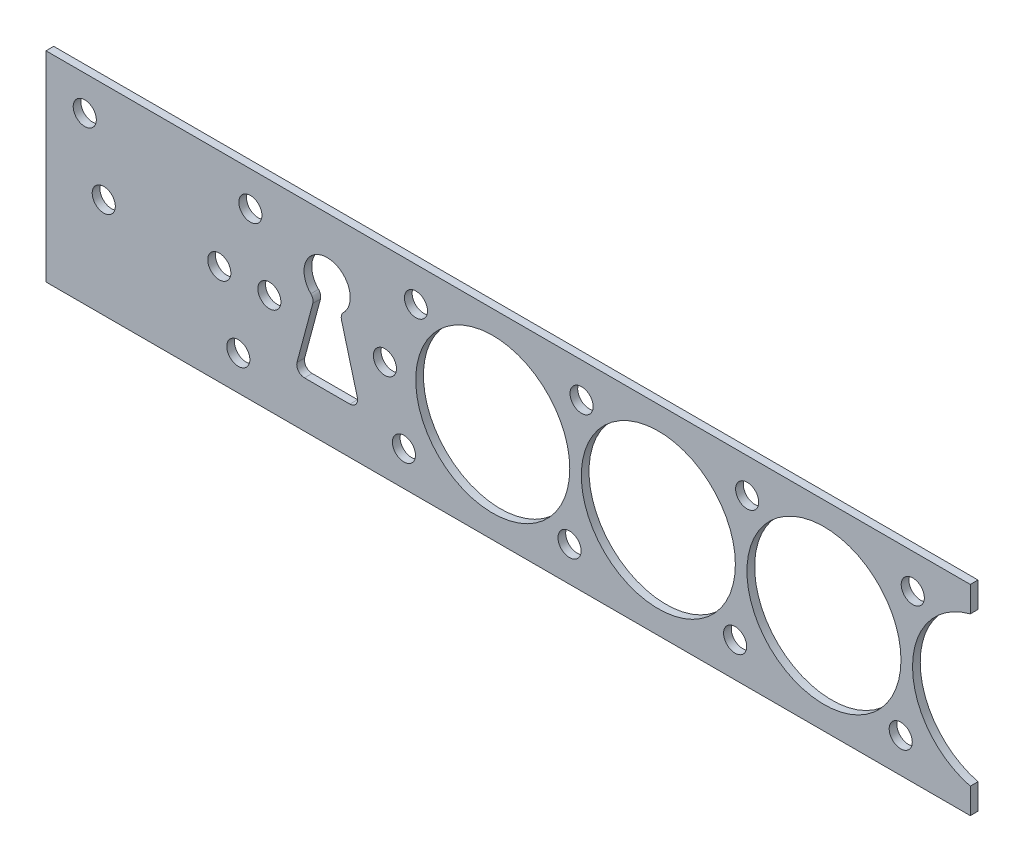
ISO-10303-21;
HEADER;
FILE_DESCRIPTION(('STEP AP214'),'2;1');
FILE_NAME('part.step','',(''),(''),'','','');
FILE_SCHEMA(('AUTOMOTIVE_DESIGN { 1 0 10303 214 1 1 1 1 }'));
ENDSEC;
DATA;
#1=APPLICATION_CONTEXT('core data for automotive mechanical design processes');
#2=APPLICATION_PROTOCOL_DEFINITION('international standard','automotive_design',2000,#1);
#3=PRODUCT_CONTEXT('',#1,'mechanical');
#4=PRODUCT('Part','Part','',(#3));
#5=PRODUCT_RELATED_PRODUCT_CATEGORY('part','',(#4));
#6=PRODUCT_DEFINITION_FORMATION('','',#4);
#7=PRODUCT_DEFINITION_CONTEXT('part definition',#1,'design');
#8=PRODUCT_DEFINITION('design','',#6,#7);
#9=PRODUCT_DEFINITION_SHAPE('','',#8);
#10=(LENGTH_UNIT() NAMED_UNIT(*) SI_UNIT(.MILLI.,.METRE.));
#11=(NAMED_UNIT(*) PLANE_ANGLE_UNIT() SI_UNIT($,.RADIAN.));
#12=(NAMED_UNIT(*) SI_UNIT($,.STERADIAN.) SOLID_ANGLE_UNIT());
#13=UNCERTAINTY_MEASURE_WITH_UNIT(LENGTH_MEASURE(1.E-05),#10,'distance_accuracy_value','');
#14=(GEOMETRIC_REPRESENTATION_CONTEXT(3) GLOBAL_UNCERTAINTY_ASSIGNED_CONTEXT((#13)) GLOBAL_UNIT_ASSIGNED_CONTEXT((#10,
#11,#12)) REPRESENTATION_CONTEXT('',''));
#15=CARTESIAN_POINT('',(0.,0.,0.));
#16=DIRECTION('',(0.,0.,1.));
#17=DIRECTION('',(1.,0.,0.));
#18=AXIS2_PLACEMENT_3D('',#15,#16,#17);
#19=CARTESIAN_POINT('',(29.,0.,123.784363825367));
#20=DIRECTION('',(0.,0.,-1.));
#21=DIRECTION('',(-1.,0.,0.));
#22=AXIS2_PLACEMENT_3D('',#19,#20,#21);
#23=CYLINDRICAL_SURFACE('',#22,1.5);
#24=CARTESIAN_POINT('',(29.,0.,0.));
#25=DIRECTION('',(0.,0.,1.));
#26=DIRECTION('',(1.,0.,0.));
#27=AXIS2_PLACEMENT_3D('',#24,#25,#26);
#28=CIRCLE('',#27,1.5);
#29=CARTESIAN_POINT('',(30.5,0.,0.));
#30=VERTEX_POINT('',#29);
#31=EDGE_CURVE('E247',#30,#30,#28,.T.);
#32=ORIENTED_EDGE('',*,*,#31,.F.);
#33=EDGE_LOOP('',(#32));
#34=FACE_BOUND('',#33,.T.);
#35=CARTESIAN_POINT('',(29.,0.,1.));
#36=DIRECTION('',(0.,0.,1.));
#37=DIRECTION('',(1.,0.,0.));
#38=AXIS2_PLACEMENT_3D('',#35,#36,#37);
#39=CIRCLE('',#38,1.5);
#40=CARTESIAN_POINT('',(30.5,0.,1.));
#41=VERTEX_POINT('',#40);
#42=EDGE_CURVE('E602',#41,#41,#39,.T.);
#43=ORIENTED_EDGE('',*,*,#42,.T.);
#44=EDGE_LOOP('',(#43));
#45=FACE_BOUND('',#44,.T.);
#46=ADVANCED_FACE('F33',(#34,#45),#23,.F.);
#47=CARTESIAN_POINT('',(97.5320513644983,8.49999999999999,123.784363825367));
#48=DIRECTION('',(0.,0.,-1.));
#49=DIRECTION('',(-1.,0.,0.));
#50=AXIS2_PLACEMENT_3D('',#47,#48,#49);
#51=CYLINDRICAL_SURFACE('',#50,1.5);
#52=CARTESIAN_POINT('',(97.5320513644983,8.49999999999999,0.));
#53=DIRECTION('',(0.,0.,1.));
#54=DIRECTION('',(1.,0.,0.));
#55=AXIS2_PLACEMENT_3D('',#52,#53,#54);
#56=CIRCLE('',#55,1.5);
#57=CARTESIAN_POINT('',(99.0320513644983,8.49999999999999,0.));
#58=VERTEX_POINT('',#57);
#59=EDGE_CURVE('E253',#58,#58,#56,.T.);
#60=ORIENTED_EDGE('',*,*,#59,.F.);
#61=EDGE_LOOP('',(#60));
#62=FACE_BOUND('',#61,.T.);
#63=CARTESIAN_POINT('',(97.5320513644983,8.49999999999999,1.));
#64=DIRECTION('',(0.,0.,1.));
#65=DIRECTION('',(1.,0.,0.));
#66=AXIS2_PLACEMENT_3D('',#63,#64,#65);
#67=CIRCLE('',#66,1.5);
#68=CARTESIAN_POINT('',(99.0320513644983,8.49999999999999,1.));
#69=VERTEX_POINT('',#68);
#70=EDGE_CURVE('E610',#69,#69,#67,.T.);
#71=ORIENTED_EDGE('',*,*,#70,.T.);
#72=EDGE_LOOP('',(#71));
#73=FACE_BOUND('',#72,.T.);
#74=ADVANCED_FACE('F352',(#62,#73),#51,.F.);
#75=CARTESIAN_POINT('',(76.0320513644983,8.49999999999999,123.784363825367));
#76=DIRECTION('',(0.,0.,-1.));
#77=DIRECTION('',(-1.,0.,0.));
#78=AXIS2_PLACEMENT_3D('',#75,#76,#77);
#79=CYLINDRICAL_SURFACE('',#78,1.5);
#80=CARTESIAN_POINT('',(76.0320513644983,8.49999999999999,0.));
#81=DIRECTION('',(0.,0.,1.));
#82=DIRECTION('',(1.,0.,0.));
#83=AXIS2_PLACEMENT_3D('',#80,#81,#82);
#84=CIRCLE('',#83,1.5);
#85=CARTESIAN_POINT('',(77.5320513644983,8.49999999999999,0.));
#86=VERTEX_POINT('',#85);
#87=EDGE_CURVE('E259',#86,#86,#84,.T.);
#88=ORIENTED_EDGE('',*,*,#87,.F.);
#89=EDGE_LOOP('',(#88));
#90=FACE_BOUND('',#89,.T.);
#91=CARTESIAN_POINT('',(76.0320513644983,8.49999999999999,1.));
#92=DIRECTION('',(0.,0.,1.));
#93=DIRECTION('',(1.,0.,0.));
#94=AXIS2_PLACEMENT_3D('',#91,#92,#93);
#95=CIRCLE('',#94,1.5);
#96=CARTESIAN_POINT('',(77.5320513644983,8.49999999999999,1.));
#97=VERTEX_POINT('',#96);
#98=EDGE_CURVE('E618',#97,#97,#95,.T.);
#99=ORIENTED_EDGE('',*,*,#98,.T.);
#100=EDGE_LOOP('',(#99));
#101=FACE_BOUND('',#100,.T.);
#102=ADVANCED_FACE('F358',(#90,#101),#79,.F.);
#103=CARTESIAN_POINT('',(54.5320513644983,8.49999999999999,123.784363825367));
#104=DIRECTION('',(0.,0.,-1.));
#105=DIRECTION('',(-1.,0.,0.));
#106=AXIS2_PLACEMENT_3D('',#103,#104,#105);
#107=CYLINDRICAL_SURFACE('',#106,1.5);
#108=CARTESIAN_POINT('',(54.5320513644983,8.49999999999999,0.));
#109=DIRECTION('',(0.,0.,1.));
#110=DIRECTION('',(1.,0.,0.));
#111=AXIS2_PLACEMENT_3D('',#108,#109,#110);
#112=CIRCLE('',#111,1.5);
#113=CARTESIAN_POINT('',(56.0320513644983,8.49999999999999,0.));
#114=VERTEX_POINT('',#113);
#115=EDGE_CURVE('E265',#114,#114,#112,.T.);
#116=ORIENTED_EDGE('',*,*,#115,.F.);
#117=EDGE_LOOP('',(#116));
#118=FACE_BOUND('',#117,.T.);
#119=CARTESIAN_POINT('',(54.5320513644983,8.49999999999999,1.));
#120=DIRECTION('',(0.,0.,1.));
#121=DIRECTION('',(1.,0.,0.));
#122=AXIS2_PLACEMENT_3D('',#119,#120,#121);
#123=CIRCLE('',#122,1.5);
#124=CARTESIAN_POINT('',(56.0320513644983,8.49999999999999,1.));
#125=VERTEX_POINT('',#124);
#126=EDGE_CURVE('E626',#125,#125,#123,.T.);
#127=ORIENTED_EDGE('',*,*,#126,.T.);
#128=EDGE_LOOP('',(#127));
#129=FACE_BOUND('',#128,.T.);
#130=ADVANCED_FACE('F378',(#118,#129),#107,.F.);
#131=CARTESIAN_POINT('',(33.0320513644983,8.49999999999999,123.784363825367));
#132=DIRECTION('',(0.,0.,-1.));
#133=DIRECTION('',(-1.,0.,0.));
#134=AXIS2_PLACEMENT_3D('',#131,#132,#133);
#135=CYLINDRICAL_SURFACE('',#134,1.5);
#136=CARTESIAN_POINT('',(33.0320513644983,8.49999999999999,0.));
#137=DIRECTION('',(0.,0.,1.));
#138=DIRECTION('',(1.,0.,0.));
#139=AXIS2_PLACEMENT_3D('',#136,#137,#138);
#140=CIRCLE('',#139,1.5);
#141=CARTESIAN_POINT('',(34.5320513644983,8.49999999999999,0.));
#142=VERTEX_POINT('',#141);
#143=EDGE_CURVE('E271',#142,#142,#140,.T.);
#144=ORIENTED_EDGE('',*,*,#143,.F.);
#145=EDGE_LOOP('',(#144));
#146=FACE_BOUND('',#145,.T.);
#147=CARTESIAN_POINT('',(33.0320513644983,8.49999999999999,1.));
#148=DIRECTION('',(0.,0.,1.));
#149=DIRECTION('',(1.,0.,0.));
#150=AXIS2_PLACEMENT_3D('',#147,#148,#149);
#151=CIRCLE('',#150,1.5);
#152=CARTESIAN_POINT('',(34.5320513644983,8.49999999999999,1.));
#153=VERTEX_POINT('',#152);
#154=EDGE_CURVE('E634',#153,#153,#151,.T.);
#155=ORIENTED_EDGE('',*,*,#154,.T.);
#156=EDGE_LOOP('',(#155));
#157=FACE_BOUND('',#156,.T.);
#158=ADVANCED_FACE('F386',(#146,#157),#135,.F.);
#159=CARTESIAN_POINT('',(11.5320513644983,8.49999999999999,123.784363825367));
#160=DIRECTION('',(0.,0.,-1.));
#161=DIRECTION('',(-1.,0.,0.));
#162=AXIS2_PLACEMENT_3D('',#159,#160,#161);
#163=CYLINDRICAL_SURFACE('',#162,1.5);
#164=CARTESIAN_POINT('',(11.5320513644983,8.49999999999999,0.));
#165=DIRECTION('',(0.,0.,1.));
#166=DIRECTION('',(1.,0.,0.));
#167=AXIS2_PLACEMENT_3D('',#164,#165,#166);
#168=CIRCLE('',#167,1.5);
#169=CARTESIAN_POINT('',(13.0320513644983,8.49999999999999,0.));
#170=VERTEX_POINT('',#169);
#171=EDGE_CURVE('E277',#170,#170,#168,.T.);
#172=ORIENTED_EDGE('',*,*,#171,.F.);
#173=EDGE_LOOP('',(#172));
#174=FACE_BOUND('',#173,.T.);
#175=CARTESIAN_POINT('',(11.5320513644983,8.49999999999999,1.));
#176=DIRECTION('',(0.,0.,1.));
#177=DIRECTION('',(1.,0.,0.));
#178=AXIS2_PLACEMENT_3D('',#175,#176,#177);
#179=CIRCLE('',#178,1.5);
#180=CARTESIAN_POINT('',(13.0320513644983,8.49999999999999,1.));
#181=VERTEX_POINT('',#180);
#182=EDGE_CURVE('E642',#181,#181,#179,.T.);
#183=ORIENTED_EDGE('',*,*,#182,.T.);
#184=EDGE_LOOP('',(#183));
#185=FACE_BOUND('',#184,.T.);
#186=ADVANCED_FACE('F394',(#174,#185),#163,.F.);
#187=CARTESIAN_POINT('',(-7.5,0.,123.784363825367));
#188=DIRECTION('',(0.,0.,-1.));
#189=DIRECTION('',(-1.,0.,0.));
#190=AXIS2_PLACEMENT_3D('',#187,#188,#189);
#191=CYLINDRICAL_SURFACE('',#190,1.5);
#192=CARTESIAN_POINT('',(-7.5,0.,0.));
#193=DIRECTION('',(0.,0.,1.));
#194=DIRECTION('',(1.,0.,0.));
#195=AXIS2_PLACEMENT_3D('',#192,#193,#194);
#196=CIRCLE('',#195,1.5);
#197=CARTESIAN_POINT('',(-6.,0.,0.));
#198=VERTEX_POINT('',#197);
#199=EDGE_CURVE('E283',#198,#198,#196,.T.);
#200=ORIENTED_EDGE('',*,*,#199,.F.);
#201=EDGE_LOOP('',(#200));
#202=FACE_BOUND('',#201,.T.);
#203=CARTESIAN_POINT('',(-7.5,0.,1.));
#204=DIRECTION('',(0.,0.,1.));
#205=DIRECTION('',(1.,0.,0.));
#206=AXIS2_PLACEMENT_3D('',#203,#204,#205);
#207=CIRCLE('',#206,1.5);
#208=CARTESIAN_POINT('',(-6.,0.,1.));
#209=VERTEX_POINT('',#208);
#210=EDGE_CURVE('E140',#209,#209,#207,.T.);
#211=ORIENTED_EDGE('',*,*,#210,.T.);
#212=EDGE_LOOP('',(#211));
#213=FACE_BOUND('',#212,.T.);
#214=ADVANCED_FACE('F402',(#202,#213),#191,.F.);
#215=CARTESIAN_POINT('',(43.,0.,123.784363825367));
#216=DIRECTION('',(0.,0.,-1.));
#217=DIRECTION('',(-1.,0.,0.));
#218=AXIS2_PLACEMENT_3D('',#215,#216,#217);
#219=CYLINDRICAL_SURFACE('',#218,10.);
#220=CARTESIAN_POINT('',(43.,0.,0.));
#221=DIRECTION('',(0.,0.,1.));
#222=DIRECTION('',(1.,0.,0.));
#223=AXIS2_PLACEMENT_3D('',#220,#221,#222);
#224=CIRCLE('',#223,10.);
#225=CARTESIAN_POINT('',(53.,0.,0.));
#226=VERTEX_POINT('',#225);
#227=EDGE_CURVE('E171',#226,#226,#224,.T.);
#228=ORIENTED_EDGE('',*,*,#227,.F.);
#229=EDGE_LOOP('',(#228));
#230=FACE_BOUND('',#229,.T.);
#231=CARTESIAN_POINT('',(43.,0.,1.));
#232=DIRECTION('',(0.,0.,1.));
#233=DIRECTION('',(1.,0.,0.));
#234=AXIS2_PLACEMENT_3D('',#231,#232,#233);
#235=CIRCLE('',#234,10.);
#236=CARTESIAN_POINT('',(53.,0.,1.));
#237=VERTEX_POINT('',#236);
#238=EDGE_CURVE('E328',#237,#237,#235,.T.);
#239=ORIENTED_EDGE('',*,*,#238,.T.);
#240=EDGE_LOOP('',(#239));
#241=FACE_BOUND('',#240,.T.);
#242=ADVANCED_FACE('F410',(#230,#241),#219,.F.);
#243=CARTESIAN_POINT('',(-9.96794863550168,8.49999999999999,123.784363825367));
#244=DIRECTION('',(0.,0.,-1.));
#245=DIRECTION('',(-1.,0.,0.));
#246=AXIS2_PLACEMENT_3D('',#243,#244,#245);
#247=CYLINDRICAL_SURFACE('',#246,1.5);
#248=CARTESIAN_POINT('',(-9.96794863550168,8.49999999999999,0.));
#249=DIRECTION('',(0.,0.,1.));
#250=DIRECTION('',(1.,0.,0.));
#251=AXIS2_PLACEMENT_3D('',#248,#249,#250);
#252=CIRCLE('',#251,1.5);
#253=CARTESIAN_POINT('',(-8.46794863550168,8.49999999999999,0.));
#254=VERTEX_POINT('',#253);
#255=EDGE_CURVE('E177',#254,#254,#252,.T.);
#256=ORIENTED_EDGE('',*,*,#255,.F.);
#257=EDGE_LOOP('',(#256));
#258=FACE_BOUND('',#257,.T.);
#259=CARTESIAN_POINT('',(-9.96794863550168,8.49999999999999,1.));
#260=DIRECTION('',(0.,0.,1.));
#261=DIRECTION('',(1.,0.,0.));
#262=AXIS2_PLACEMENT_3D('',#259,#260,#261);
#263=CIRCLE('',#262,1.5);
#264=CARTESIAN_POINT('',(-8.46794863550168,8.49999999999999,1.));
#265=VERTEX_POINT('',#264);
#266=EDGE_CURVE('E334',#265,#265,#263,.T.);
#267=ORIENTED_EDGE('',*,*,#266,.T.);
#268=EDGE_LOOP('',(#267));
#269=FACE_BOUND('',#268,.T.);
#270=ADVANCED_FACE('F438',(#258,#269),#247,.F.);
#271=CARTESIAN_POINT('',(-15.,13.,123.784363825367));
#272=DIRECTION('',(0.,-1.,0.));
#273=DIRECTION('',(0.,0.,-1.));
#274=AXIS2_PLACEMENT_3D('',#271,#272,#273);
#275=PLANE('',#274);
#276=DIRECTION('',(-1.,0.,0.));
#277=VECTOR('',#276,1.);
#278=CARTESIAN_POINT('',(-15.,13.,1.));
#279=LINE('',#278,#277);
#280=CARTESIAN_POINT('',(105.,13.,1.));
#281=VERTEX_POINT('',#280);
#282=CARTESIAN_POINT('',(-15.,13.,1.));
#283=VERTEX_POINT('',#282);
#284=EDGE_CURVE('E337',#281,#283,#279,.T.);
#285=ORIENTED_EDGE('',*,*,#284,.F.);
#286=DIRECTION('',(0.,0.,-1.));
#287=VECTOR('',#286,1.);
#288=CARTESIAN_POINT('',(105.,13.,123.784363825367));
#289=LINE('',#288,#287);
#290=CARTESIAN_POINT('',(105.,13.,0.));
#291=VERTEX_POINT('',#290);
#292=EDGE_CURVE('E49',#281,#291,#289,.T.);
#293=ORIENTED_EDGE('',*,*,#292,.T.);
#294=DIRECTION('',(-1.,0.,0.));
#295=VECTOR('',#294,1.);
#296=CARTESIAN_POINT('',(-15.,13.,0.));
#297=LINE('',#296,#295);
#298=CARTESIAN_POINT('',(-15.,13.,0.));
#299=VERTEX_POINT('',#298);
#300=EDGE_CURVE('E194',#291,#299,#297,.T.);
#301=ORIENTED_EDGE('',*,*,#300,.T.);
#302=DIRECTION('',(0.,0.,-1.));
#303=VECTOR('',#302,1.);
#304=CARTESIAN_POINT('',(-15.,13.,123.784363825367));
#305=LINE('',#304,#303);
#306=EDGE_CURVE('E197',#283,#299,#305,.T.);
#307=ORIENTED_EDGE('',*,*,#306,.F.);
#308=EDGE_LOOP('',(#285,#293,#301,#307));
#309=FACE_BOUND('',#308,.T.);
#310=ADVANCED_FACE('F340',(#309),#275,.F.);
#311=CARTESIAN_POINT('',(105.,13.,123.784363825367));
#312=DIRECTION('',(-1.,0.,0.));
#313=DIRECTION('',(0.,0.,1.));
#314=AXIS2_PLACEMENT_3D('',#311,#312,#313);
#315=PLANE('',#314);
#316=DIRECTION('',(0.,1.,0.));
#317=VECTOR('',#316,1.);
#318=CARTESIAN_POINT('',(105.,13.,1.));
#319=LINE('',#318,#317);
#320=CARTESIAN_POINT('',(105.,9.68245836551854,1.));
#321=VERTEX_POINT('',#320);
#322=EDGE_CURVE('E236',#321,#281,#319,.T.);
#323=ORIENTED_EDGE('',*,*,#322,.F.);
#324=DIRECTION('',(0.,0.,-1.));
#325=VECTOR('',#324,1.);
#326=CARTESIAN_POINT('',(105.,9.68245836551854,123.784363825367));
#327=LINE('',#326,#325);
#328=CARTESIAN_POINT('',(105.,9.68245836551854,0.));
#329=VERTEX_POINT('',#328);
#330=EDGE_CURVE('E200',#321,#329,#327,.T.);
#331=ORIENTED_EDGE('',*,*,#330,.T.);
#332=DIRECTION('',(0.,1.,0.));
#333=VECTOR('',#332,1.);
#334=CARTESIAN_POINT('',(105.,13.,0.));
#335=LINE('',#334,#333);
#336=EDGE_CURVE('E192',#329,#291,#335,.T.);
#337=ORIENTED_EDGE('',*,*,#336,.T.);
#338=ORIENTED_EDGE('',*,*,#292,.F.);
#339=EDGE_LOOP('',(#323,#331,#337,#338));
#340=FACE_BOUND('',#339,.T.);
#341=ADVANCED_FACE('F338',(#340),#315,.F.);
#342=CARTESIAN_POINT('',(107.5,0.,123.784363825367));
#343=DIRECTION('',(0.,0.,-1.));
#344=DIRECTION('',(-1.,0.,0.));
#345=AXIS2_PLACEMENT_3D('',#342,#343,#344);
#346=CYLINDRICAL_SURFACE('',#345,9.99999999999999);
#347=CARTESIAN_POINT('',(107.5,0.,1.));
#348=DIRECTION('',(0.,0.,1.));
#349=DIRECTION('',(1.,0.,0.));
#350=AXIS2_PLACEMENT_3D('',#347,#348,#349);
#351=CIRCLE('',#350,9.99999999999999);
#352=CARTESIAN_POINT('',(105.,-9.68245836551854,1.));
#353=VERTEX_POINT('',#352);
#354=EDGE_CURVE('E227',#353,#321,#351,.F.);
#355=ORIENTED_EDGE('',*,*,#354,.F.);
#356=DIRECTION('',(0.,0.,-1.));
#357=VECTOR('',#356,1.);
#358=CARTESIAN_POINT('',(105.,-9.68245836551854,123.784363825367));
#359=LINE('',#358,#357);
#360=CARTESIAN_POINT('',(105.,-9.68245836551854,0.));
#361=VERTEX_POINT('',#360);
#362=EDGE_CURVE('E202',#353,#361,#359,.T.);
#363=ORIENTED_EDGE('',*,*,#362,.T.);
#364=CARTESIAN_POINT('',(107.5,0.,0.));
#365=DIRECTION('',(0.,0.,-1.));
#366=DIRECTION('',(1.,0.,0.));
#367=AXIS2_PLACEMENT_3D('',#364,#365,#366);
#368=CIRCLE('',#367,9.99999999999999);
#369=EDGE_CURVE('E189',#361,#329,#368,.T.);
#370=ORIENTED_EDGE('',*,*,#369,.T.);
#371=ORIENTED_EDGE('',*,*,#330,.F.);
#372=EDGE_LOOP('',(#355,#363,#370,#371));
#373=FACE_BOUND('',#372,.T.);
#374=ADVANCED_FACE('F225',(#373),#346,.F.);
#375=CARTESIAN_POINT('',(105.,-9.68245836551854,123.784363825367));
#376=DIRECTION('',(-1.,0.,0.));
#377=DIRECTION('',(0.,0.,1.));
#378=AXIS2_PLACEMENT_3D('',#375,#376,#377);
#379=PLANE('',#378);
#380=DIRECTION('',(0.,1.,0.));
#381=VECTOR('',#380,1.);
#382=CARTESIAN_POINT('',(105.,-9.68245836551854,1.));
#383=LINE('',#382,#381);
#384=CARTESIAN_POINT('',(105.,-13.,1.));
#385=VERTEX_POINT('',#384);
#386=EDGE_CURVE('E211',#385,#353,#383,.T.);
#387=ORIENTED_EDGE('',*,*,#386,.F.);
#388=DIRECTION('',(0.,0.,-1.));
#389=VECTOR('',#388,1.);
#390=CARTESIAN_POINT('',(105.,-13.,123.784363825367));
#391=LINE('',#390,#389);
#392=CARTESIAN_POINT('',(105.,-13.,0.));
#393=VERTEX_POINT('',#392);
#394=EDGE_CURVE('E42',#385,#393,#391,.T.);
#395=ORIENTED_EDGE('',*,*,#394,.T.);
#396=DIRECTION('',(0.,1.,0.));
#397=VECTOR('',#396,1.);
#398=CARTESIAN_POINT('',(105.,-9.68245836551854,0.));
#399=LINE('',#398,#397);
#400=EDGE_CURVE('E186',#393,#361,#399,.T.);
#401=ORIENTED_EDGE('',*,*,#400,.T.);
#402=ORIENTED_EDGE('',*,*,#362,.F.);
#403=EDGE_LOOP('',(#387,#395,#401,#402));
#404=FACE_BOUND('',#403,.T.);
#405=ADVANCED_FACE('F206',(#404),#379,.F.);
#406=CARTESIAN_POINT('',(-15.,-13.,123.784363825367));
#407=DIRECTION('',(0.,1.,0.));
#408=DIRECTION('',(0.,0.,1.));
#409=AXIS2_PLACEMENT_3D('',#406,#407,#408);
#410=PLANE('',#409);
#411=DIRECTION('',(1.,0.,0.));
#412=VECTOR('',#411,1.);
#413=CARTESIAN_POINT('',(-15.,-13.,1.));
#414=LINE('',#413,#412);
#415=CARTESIAN_POINT('',(-15.,-13.,1.));
#416=VERTEX_POINT('',#415);
#417=EDGE_CURVE('E232',#416,#385,#414,.T.);
#418=ORIENTED_EDGE('',*,*,#417,.F.);
#419=DIRECTION('',(0.,0.,-1.));
#420=VECTOR('',#419,1.);
#421=CARTESIAN_POINT('',(-15.,-13.,123.784363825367));
#422=LINE('',#421,#420);
#423=CARTESIAN_POINT('',(-15.,-13.,0.));
#424=VERTEX_POINT('',#423);
#425=EDGE_CURVE('E11',#416,#424,#422,.T.);
#426=ORIENTED_EDGE('',*,*,#425,.T.);
#427=DIRECTION('',(1.,0.,0.));
#428=VECTOR('',#427,1.);
#429=CARTESIAN_POINT('',(-15.,-13.,0.));
#430=LINE('',#429,#428);
#431=EDGE_CURVE('E183',#424,#393,#430,.T.);
#432=ORIENTED_EDGE('',*,*,#431,.T.);
#433=ORIENTED_EDGE('',*,*,#394,.F.);
#434=EDGE_LOOP('',(#418,#426,#432,#433));
#435=FACE_BOUND('',#434,.T.);
#436=ADVANCED_FACE('F215',(#435),#410,.F.);
#437=CARTESIAN_POINT('',(-15.,13.,123.784363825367));
#438=DIRECTION('',(1.,0.,0.));
#439=DIRECTION('',(0.,0.,-1.));
#440=AXIS2_PLACEMENT_3D('',#437,#438,#439);
#441=PLANE('',#440);
#442=DIRECTION('',(0.,-1.,0.));
#443=VECTOR('',#442,1.);
#444=CARTESIAN_POINT('',(-15.,13.,1.));
#445=LINE('',#444,#443);
#446=EDGE_CURVE('E234',#283,#416,#445,.T.);
#447=ORIENTED_EDGE('',*,*,#446,.F.);
#448=ORIENTED_EDGE('',*,*,#306,.T.);
#449=DIRECTION('',(0.,-1.,0.));
#450=VECTOR('',#449,1.);
#451=CARTESIAN_POINT('',(-15.,13.,0.));
#452=LINE('',#451,#450);
#453=EDGE_CURVE('E180',#299,#424,#452,.T.);
#454=ORIENTED_EDGE('',*,*,#453,.T.);
#455=ORIENTED_EDGE('',*,*,#425,.F.);
#456=EDGE_LOOP('',(#447,#448,#454,#455));
#457=FACE_BOUND('',#456,.T.);
#458=ADVANCED_FACE('F35',(#457),#441,.F.);
#459=CARTESIAN_POINT('',(9.96794863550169,-8.5,123.784363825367));
#460=DIRECTION('',(0.,0.,-1.));
#461=DIRECTION('',(-1.,0.,0.));
#462=AXIS2_PLACEMENT_3D('',#459,#460,#461);
#463=CYLINDRICAL_SURFACE('',#462,1.5);
#464=CARTESIAN_POINT('',(9.96794863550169,-8.5,0.));
#465=DIRECTION('',(0.,0.,1.));
#466=DIRECTION('',(1.,0.,0.));
#467=AXIS2_PLACEMENT_3D('',#464,#465,#466);
#468=CIRCLE('',#467,1.5);
#469=CARTESIAN_POINT('',(11.4679486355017,-8.5,0.));
#470=VERTEX_POINT('',#469);
#471=EDGE_CURVE('E174',#470,#470,#468,.T.);
#472=ORIENTED_EDGE('',*,*,#471,.F.);
#473=EDGE_LOOP('',(#472));
#474=FACE_BOUND('',#473,.T.);
#475=CARTESIAN_POINT('',(9.96794863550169,-8.5,1.));
#476=DIRECTION('',(0.,0.,1.));
#477=DIRECTION('',(1.,0.,0.));
#478=AXIS2_PLACEMENT_3D('',#475,#476,#477);
#479=CIRCLE('',#478,1.5);
#480=CARTESIAN_POINT('',(11.4679486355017,-8.5,1.));
#481=VERTEX_POINT('',#480);
#482=EDGE_CURVE('E331',#481,#481,#479,.T.);
#483=ORIENTED_EDGE('',*,*,#482,.T.);
#484=EDGE_LOOP('',(#483));
#485=FACE_BOUND('',#484,.T.);
#486=ADVANCED_FACE('F344',(#474,#485),#463,.F.);
#487=CARTESIAN_POINT('',(25.4133669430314,-5.74118095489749,123.784363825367));
#488=DIRECTION('',(-0.96592582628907,-0.258819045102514,0.));
#489=DIRECTION('',(0.258819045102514,-0.96592582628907,0.));
#490=AXIS2_PLACEMENT_3D('',#487,#488,#489);
#491=PLANE('',#490);
#492=DIRECTION('',(0.,0.,-1.));
#493=VECTOR('',#492,1.);
#494=CARTESIAN_POINT('',(25.4133669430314,-5.74118095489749,123.784363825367));
#495=LINE('',#494,#493);
#496=CARTESIAN_POINT('',(25.4133669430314,-5.74118095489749,1.));
#497=VERTEX_POINT('',#496);
#498=CARTESIAN_POINT('',(25.4133669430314,-5.74118095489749,0.));
#499=VERTEX_POINT('',#498);
#500=EDGE_CURVE('E145',#497,#499,#495,.T.);
#501=ORIENTED_EDGE('',*,*,#500,.F.);
#502=DIRECTION('',(-0.258819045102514,0.96592582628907,0.));
#503=VECTOR('',#502,1.);
#504=CARTESIAN_POINT('',(25.4133669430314,-5.74118095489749,1.));
#505=LINE('',#504,#503);
#506=CARTESIAN_POINT('',(23.3625012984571,1.9127538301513,1.));
#507=VERTEX_POINT('',#506);
#508=EDGE_CURVE('E132',#497,#507,#505,.T.);
#509=ORIENTED_EDGE('',*,*,#508,.T.);
#510=DIRECTION('',(0.,0.,-1.));
#511=VECTOR('',#510,1.);
#512=CARTESIAN_POINT('',(23.3625012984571,1.9127538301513,123.784363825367));
#513=LINE('',#512,#511);
#514=CARTESIAN_POINT('',(23.3625012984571,1.9127538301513,0.));
#515=VERTEX_POINT('',#514);
#516=EDGE_CURVE('E155',#507,#515,#513,.T.);
#517=ORIENTED_EDGE('',*,*,#516,.T.);
#518=DIRECTION('',(-0.258819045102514,0.96592582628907,0.));
#519=VECTOR('',#518,1.);
#520=CARTESIAN_POINT('',(25.4133669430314,-5.74118095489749,0.));
#521=LINE('',#520,#519);
#522=EDGE_CURVE('E153',#499,#515,#521,.T.);
#523=ORIENTED_EDGE('',*,*,#522,.F.);
#524=EDGE_LOOP('',(#501,#509,#517,#523));
#525=FACE_BOUND('',#524,.T.);
#526=ADVANCED_FACE('F151',(#525),#491,.T.);
#527=CARTESIAN_POINT('',(24.4474411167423,-6.,123.784363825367));
#528=DIRECTION('',(0.,0.,-1.));
#529=DIRECTION('',(-1.,0.,0.));
#530=AXIS2_PLACEMENT_3D('',#527,#528,#529);
#531=CYLINDRICAL_SURFACE('',#530,1.);
#532=DIRECTION('',(0.,0.,-1.));
#533=VECTOR('',#532,1.);
#534=CARTESIAN_POINT('',(24.4474411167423,-7.,123.784363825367));
#535=LINE('',#534,#533);
#536=CARTESIAN_POINT('',(24.4474411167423,-7.,1.));
#537=VERTEX_POINT('',#536);
#538=CARTESIAN_POINT('',(24.4474411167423,-7.,0.));
#539=VERTEX_POINT('',#538);
#540=EDGE_CURVE('E147',#537,#539,#535,.T.);
#541=ORIENTED_EDGE('',*,*,#540,.F.);
#542=CARTESIAN_POINT('',(24.4474411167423,-6.,1.));
#543=DIRECTION('',(0.,0.,1.));
#544=DIRECTION('',(1.,0.,0.));
#545=AXIS2_PLACEMENT_3D('',#542,#543,#544);
#546=CIRCLE('',#545,1.);
#547=EDGE_CURVE('E136',#537,#497,#546,.T.);
#548=ORIENTED_EDGE('',*,*,#547,.T.);
#549=ORIENTED_EDGE('',*,*,#500,.T.);
#550=CARTESIAN_POINT('',(24.4474411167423,-6.,0.));
#551=DIRECTION('',(0.,0.,1.));
#552=DIRECTION('',(1.,0.,0.));
#553=AXIS2_PLACEMENT_3D('',#550,#551,#552);
#554=CIRCLE('',#553,1.);
#555=EDGE_CURVE('E304',#539,#499,#554,.T.);
#556=ORIENTED_EDGE('',*,*,#555,.F.);
#557=EDGE_LOOP('',(#541,#548,#549,#556));
#558=FACE_BOUND('',#557,.T.);
#559=ADVANCED_FACE('F143',(#558),#531,.F.);
#560=CARTESIAN_POINT('',(18.5525588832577,-7.,123.784363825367));
#561=DIRECTION('',(0.,1.,0.));
#562=DIRECTION('',(-1.,0.,0.));
#563=AXIS2_PLACEMENT_3D('',#560,#561,#562);
#564=PLANE('',#563);
#565=DIRECTION('',(0.,0.,-1.));
#566=VECTOR('',#565,1.);
#567=CARTESIAN_POINT('',(18.5525588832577,-7.,123.784363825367));
#568=LINE('',#567,#566);
#569=CARTESIAN_POINT('',(18.5525588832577,-7.,1.));
#570=VERTEX_POINT('',#569);
#571=CARTESIAN_POINT('',(18.5525588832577,-7.,0.));
#572=VERTEX_POINT('',#571);
#573=EDGE_CURVE('E157',#570,#572,#568,.T.);
#574=ORIENTED_EDGE('',*,*,#573,.F.);
#575=DIRECTION('',(1.,0.,0.));
#576=VECTOR('',#575,1.);
#577=CARTESIAN_POINT('',(18.5525588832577,-7.,1.));
#578=LINE('',#577,#576);
#579=EDGE_CURVE('E149',#570,#537,#578,.T.);
#580=ORIENTED_EDGE('',*,*,#579,.T.);
#581=ORIENTED_EDGE('',*,*,#540,.T.);
#582=DIRECTION('',(1.,0.,0.));
#583=VECTOR('',#582,1.);
#584=CARTESIAN_POINT('',(18.5525588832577,-7.,0.));
#585=LINE('',#584,#583);
#586=EDGE_CURVE('E301',#572,#539,#585,.T.);
#587=ORIENTED_EDGE('',*,*,#586,.F.);
#588=EDGE_LOOP('',(#574,#580,#581,#587));
#589=FACE_BOUND('',#588,.T.);
#590=ADVANCED_FACE('F312',(#589),#564,.T.);
#591=CARTESIAN_POINT('',(18.5525588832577,-6.,123.784363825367));
#592=DIRECTION('',(0.,0.,-1.));
#593=DIRECTION('',(-1.,0.,0.));
#594=AXIS2_PLACEMENT_3D('',#591,#592,#593);
#595=CYLINDRICAL_SURFACE('',#594,1.);
#596=DIRECTION('',(0.,0.,-1.));
#597=VECTOR('',#596,1.);
#598=CARTESIAN_POINT('',(17.5866330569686,-5.74118095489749,123.784363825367));
#599=LINE('',#598,#597);
#600=CARTESIAN_POINT('',(17.5866330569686,-5.74118095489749,1.));
#601=VERTEX_POINT('',#600);
#602=CARTESIAN_POINT('',(17.5866330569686,-5.74118095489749,0.));
#603=VERTEX_POINT('',#602);
#604=EDGE_CURVE('E163',#601,#603,#599,.T.);
#605=ORIENTED_EDGE('',*,*,#604,.F.);
#606=CARTESIAN_POINT('',(18.5525588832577,-6.,1.));
#607=DIRECTION('',(0.,0.,1.));
#608=DIRECTION('',(1.,0.,0.));
#609=AXIS2_PLACEMENT_3D('',#606,#607,#608);
#610=CIRCLE('',#609,1.);
#611=EDGE_CURVE('E314',#601,#570,#610,.T.);
#612=ORIENTED_EDGE('',*,*,#611,.T.);
#613=ORIENTED_EDGE('',*,*,#573,.T.);
#614=CARTESIAN_POINT('',(18.5525588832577,-6.,0.));
#615=DIRECTION('',(0.,0.,1.));
#616=DIRECTION('',(1.,0.,0.));
#617=AXIS2_PLACEMENT_3D('',#614,#615,#616);
#618=CIRCLE('',#617,1.);
#619=EDGE_CURVE('E298',#603,#572,#618,.T.);
#620=ORIENTED_EDGE('',*,*,#619,.F.);
#621=EDGE_LOOP('',(#605,#612,#613,#620));
#622=FACE_BOUND('',#621,.T.);
#623=ADVANCED_FACE('F418',(#622),#595,.F.);
#624=CARTESIAN_POINT('',(19.6374987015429,1.9127538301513,123.784363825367));
#625=DIRECTION('',(0.96592582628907,-0.258819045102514,0.));
#626=DIRECTION('',(0.258819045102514,0.96592582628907,0.));
#627=AXIS2_PLACEMENT_3D('',#624,#625,#626);
#628=PLANE('',#627);
#629=DIRECTION('',(0.,0.,-1.));
#630=VECTOR('',#629,1.);
#631=CARTESIAN_POINT('',(19.6374987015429,1.9127538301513,123.784363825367));
#632=LINE('',#631,#630);
#633=CARTESIAN_POINT('',(19.6374987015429,1.9127538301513,1.));
#634=VERTEX_POINT('',#633);
#635=CARTESIAN_POINT('',(19.6374987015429,1.9127538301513,0.));
#636=VERTEX_POINT('',#635);
#637=EDGE_CURVE('E165',#634,#636,#632,.T.);
#638=ORIENTED_EDGE('',*,*,#637,.F.);
#639=DIRECTION('',(-0.258819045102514,-0.96592582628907,0.));
#640=VECTOR('',#639,1.);
#641=CARTESIAN_POINT('',(19.6374987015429,1.9127538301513,1.));
#642=LINE('',#641,#640);
#643=EDGE_CURVE('E316',#634,#601,#642,.T.);
#644=ORIENTED_EDGE('',*,*,#643,.T.);
#645=ORIENTED_EDGE('',*,*,#604,.T.);
#646=DIRECTION('',(-0.258819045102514,-0.96592582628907,0.));
#647=VECTOR('',#646,1.);
#648=CARTESIAN_POINT('',(19.6374987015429,1.9127538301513,0.));
#649=LINE('',#648,#647);
#650=EDGE_CURVE('E295',#636,#603,#649,.T.);
#651=ORIENTED_EDGE('',*,*,#650,.F.);
#652=EDGE_LOOP('',(#638,#644,#645,#651));
#653=FACE_BOUND('',#652,.T.);
#654=ADVANCED_FACE('F421',(#653),#628,.T.);
#655=CARTESIAN_POINT('',(18.6715728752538,2.17157287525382,123.784363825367));
#656=DIRECTION('',(0.,0.,-1.));
#657=DIRECTION('',(-1.,0.,0.));
#658=AXIS2_PLACEMENT_3D('',#655,#656,#657);
#659=CYLINDRICAL_SURFACE('',#658,1.);
#660=DIRECTION('',(0.,0.,-1.));
#661=VECTOR('',#660,1.);
#662=CARTESIAN_POINT('',(19.3786796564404,2.87867965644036,123.784363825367));
#663=LINE('',#662,#661);
#664=CARTESIAN_POINT('',(19.3786796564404,2.87867965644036,1.));
#665=VERTEX_POINT('',#664);
#666=CARTESIAN_POINT('',(19.3786796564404,2.87867965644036,0.));
#667=VERTEX_POINT('',#666);
#668=EDGE_CURVE('E167',#665,#667,#663,.T.);
#669=ORIENTED_EDGE('',*,*,#668,.F.);
#670=CARTESIAN_POINT('',(18.6715728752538,2.17157287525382,1.));
#671=DIRECTION('',(0.,0.,1.));
#672=DIRECTION('',(1.,0.,0.));
#673=AXIS2_PLACEMENT_3D('',#670,#671,#672);
#674=CIRCLE('',#673,1.);
#675=EDGE_CURVE('E321',#665,#634,#674,.F.);
#676=ORIENTED_EDGE('',*,*,#675,.T.);
#677=ORIENTED_EDGE('',*,*,#637,.T.);
#678=CARTESIAN_POINT('',(18.6715728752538,2.17157287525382,0.));
#679=DIRECTION('',(0.,0.,-1.));
#680=DIRECTION('',(1.,0.,0.));
#681=AXIS2_PLACEMENT_3D('',#678,#679,#680);
#682=CIRCLE('',#681,1.);
#683=EDGE_CURVE('E292',#667,#636,#682,.T.);
#684=ORIENTED_EDGE('',*,*,#683,.F.);
#685=EDGE_LOOP('',(#669,#676,#677,#684));
#686=FACE_BOUND('',#685,.T.);
#687=ADVANCED_FACE('F425',(#686),#659,.T.);
#688=CARTESIAN_POINT('',(21.5,5.,123.784363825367));
#689=DIRECTION('',(0.,0.,-1.));
#690=DIRECTION('',(-1.,0.,0.));
#691=AXIS2_PLACEMENT_3D('',#688,#689,#690);
#692=CYLINDRICAL_SURFACE('',#691,3.);
#693=DIRECTION('',(0.,0.,-1.));
#694=VECTOR('',#693,1.);
#695=CARTESIAN_POINT('',(23.6213203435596,2.87867965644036,123.784363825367));
#696=LINE('',#695,#694);
#697=CARTESIAN_POINT('',(23.6213203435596,2.87867965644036,1.));
#698=VERTEX_POINT('',#697);
#699=CARTESIAN_POINT('',(23.6213203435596,2.87867965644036,0.));
#700=VERTEX_POINT('',#699);
#701=EDGE_CURVE('E169',#698,#700,#696,.T.);
#702=ORIENTED_EDGE('',*,*,#701,.F.);
#703=CARTESIAN_POINT('',(21.5,5.,1.));
#704=DIRECTION('',(0.,0.,1.));
#705=DIRECTION('',(1.,0.,0.));
#706=AXIS2_PLACEMENT_3D('',#703,#704,#705);
#707=CIRCLE('',#706,3.);
#708=EDGE_CURVE('E324',#698,#665,#707,.T.);
#709=ORIENTED_EDGE('',*,*,#708,.T.);
#710=ORIENTED_EDGE('',*,*,#668,.T.);
#711=CARTESIAN_POINT('',(21.5,5.,0.));
#712=DIRECTION('',(0.,0.,1.));
#713=DIRECTION('',(1.,0.,0.));
#714=AXIS2_PLACEMENT_3D('',#711,#712,#713);
#715=CIRCLE('',#714,3.);
#716=EDGE_CURVE('E289',#700,#667,#715,.T.);
#717=ORIENTED_EDGE('',*,*,#716,.F.);
#718=EDGE_LOOP('',(#702,#709,#710,#717));
#719=FACE_BOUND('',#718,.T.);
#720=ADVANCED_FACE('F429',(#719),#692,.F.);
#721=CARTESIAN_POINT('',(24.3284271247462,2.17157287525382,123.784363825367));
#722=DIRECTION('',(0.,0.,-1.));
#723=DIRECTION('',(-1.,0.,0.));
#724=AXIS2_PLACEMENT_3D('',#721,#722,#723);
#725=CYLINDRICAL_SURFACE('',#724,1.);
#726=ORIENTED_EDGE('',*,*,#516,.F.);
#727=CARTESIAN_POINT('',(24.3284271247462,2.17157287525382,1.));
#728=DIRECTION('',(0.,0.,1.));
#729=DIRECTION('',(1.,0.,0.));
#730=AXIS2_PLACEMENT_3D('',#727,#728,#729);
#731=CIRCLE('',#730,1.);
#732=EDGE_CURVE('E57',#507,#698,#731,.F.);
#733=ORIENTED_EDGE('',*,*,#732,.T.);
#734=ORIENTED_EDGE('',*,*,#701,.T.);
#735=CARTESIAN_POINT('',(24.3284271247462,2.17157287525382,0.));
#736=DIRECTION('',(0.,0.,-1.));
#737=DIRECTION('',(1.,0.,0.));
#738=AXIS2_PLACEMENT_3D('',#735,#736,#737);
#739=CIRCLE('',#738,1.);
#740=EDGE_CURVE('E286',#515,#700,#739,.T.);
#741=ORIENTED_EDGE('',*,*,#740,.F.);
#742=EDGE_LOOP('',(#726,#733,#734,#741));
#743=FACE_BOUND('',#742,.T.);
#744=ADVANCED_FACE('F406',(#743),#725,.T.);
#745=CARTESIAN_POINT('',(7.5,0.,123.784363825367));
#746=DIRECTION('',(0.,0.,-1.));
#747=DIRECTION('',(-1.,0.,0.));
#748=AXIS2_PLACEMENT_3D('',#745,#746,#747);
#749=CYLINDRICAL_SURFACE('',#748,1.5);
#750=CARTESIAN_POINT('',(7.5,0.,0.));
#751=DIRECTION('',(0.,0.,1.));
#752=DIRECTION('',(1.,0.,0.));
#753=AXIS2_PLACEMENT_3D('',#750,#751,#752);
#754=CIRCLE('',#753,1.5);
#755=CARTESIAN_POINT('',(9.00000000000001,0.,0.));
#756=VERTEX_POINT('',#755);
#757=EDGE_CURVE('E280',#756,#756,#754,.T.);
#758=ORIENTED_EDGE('',*,*,#757,.F.);
#759=EDGE_LOOP('',(#758));
#760=FACE_BOUND('',#759,.T.);
#761=CARTESIAN_POINT('',(7.5,0.,1.));
#762=DIRECTION('',(0.,0.,1.));
#763=DIRECTION('',(1.,0.,0.));
#764=AXIS2_PLACEMENT_3D('',#761,#762,#763);
#765=CIRCLE('',#764,1.5);
#766=CARTESIAN_POINT('',(9.00000000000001,0.,1.));
#767=VERTEX_POINT('',#766);
#768=EDGE_CURVE('E646',#767,#767,#765,.T.);
#769=ORIENTED_EDGE('',*,*,#768,.T.);
#770=EDGE_LOOP('',(#769));
#771=FACE_BOUND('',#770,.T.);
#772=ADVANCED_FACE('F398',(#760,#771),#749,.F.);
#773=CARTESIAN_POINT('',(31.4679486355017,-8.5,123.784363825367));
#774=DIRECTION('',(0.,0.,-1.));
#775=DIRECTION('',(-1.,0.,0.));
#776=AXIS2_PLACEMENT_3D('',#773,#774,#775);
#777=CYLINDRICAL_SURFACE('',#776,1.5);
#778=CARTESIAN_POINT('',(31.4679486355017,-8.5,0.));
#779=DIRECTION('',(0.,0.,1.));
#780=DIRECTION('',(1.,0.,0.));
#781=AXIS2_PLACEMENT_3D('',#778,#779,#780);
#782=CIRCLE('',#781,1.5);
#783=CARTESIAN_POINT('',(32.9679486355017,-8.5,0.));
#784=VERTEX_POINT('',#783);
#785=EDGE_CURVE('E274',#784,#784,#782,.T.);
#786=ORIENTED_EDGE('',*,*,#785,.F.);
#787=EDGE_LOOP('',(#786));
#788=FACE_BOUND('',#787,.T.);
#789=CARTESIAN_POINT('',(31.4679486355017,-8.5,1.));
#790=DIRECTION('',(0.,0.,1.));
#791=DIRECTION('',(1.,0.,0.));
#792=AXIS2_PLACEMENT_3D('',#789,#790,#791);
#793=CIRCLE('',#792,1.5);
#794=CARTESIAN_POINT('',(32.9679486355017,-8.5,1.));
#795=VERTEX_POINT('',#794);
#796=EDGE_CURVE('E638',#795,#795,#793,.T.);
#797=ORIENTED_EDGE('',*,*,#796,.T.);
#798=EDGE_LOOP('',(#797));
#799=FACE_BOUND('',#798,.T.);
#800=ADVANCED_FACE('F390',(#788,#799),#777,.F.);
#801=CARTESIAN_POINT('',(52.9679486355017,-8.5,123.784363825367));
#802=DIRECTION('',(0.,0.,-1.));
#803=DIRECTION('',(-1.,0.,0.));
#804=AXIS2_PLACEMENT_3D('',#801,#802,#803);
#805=CYLINDRICAL_SURFACE('',#804,1.5);
#806=CARTESIAN_POINT('',(52.9679486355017,-8.5,0.));
#807=DIRECTION('',(0.,0.,1.));
#808=DIRECTION('',(1.,0.,0.));
#809=AXIS2_PLACEMENT_3D('',#806,#807,#808);
#810=CIRCLE('',#809,1.5);
#811=CARTESIAN_POINT('',(54.4679486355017,-8.5,0.));
#812=VERTEX_POINT('',#811);
#813=EDGE_CURVE('E268',#812,#812,#810,.T.);
#814=ORIENTED_EDGE('',*,*,#813,.F.);
#815=EDGE_LOOP('',(#814));
#816=FACE_BOUND('',#815,.T.);
#817=CARTESIAN_POINT('',(52.9679486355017,-8.5,1.));
#818=DIRECTION('',(0.,0.,1.));
#819=DIRECTION('',(1.,0.,0.));
#820=AXIS2_PLACEMENT_3D('',#817,#818,#819);
#821=CIRCLE('',#820,1.5);
#822=CARTESIAN_POINT('',(54.4679486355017,-8.5,1.));
#823=VERTEX_POINT('',#822);
#824=EDGE_CURVE('E630',#823,#823,#821,.T.);
#825=ORIENTED_EDGE('',*,*,#824,.T.);
#826=EDGE_LOOP('',(#825));
#827=FACE_BOUND('',#826,.T.);
#828=ADVANCED_FACE('F382',(#816,#827),#805,.F.);
#829=CARTESIAN_POINT('',(74.4679486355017,-8.5,123.784363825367));
#830=DIRECTION('',(0.,0.,-1.));
#831=DIRECTION('',(-1.,0.,0.));
#832=AXIS2_PLACEMENT_3D('',#829,#830,#831);
#833=CYLINDRICAL_SURFACE('',#832,1.5);
#834=CARTESIAN_POINT('',(74.4679486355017,-8.5,0.));
#835=DIRECTION('',(0.,0.,1.));
#836=DIRECTION('',(1.,0.,0.));
#837=AXIS2_PLACEMENT_3D('',#834,#835,#836);
#838=CIRCLE('',#837,1.5);
#839=CARTESIAN_POINT('',(75.9679486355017,-8.5,0.));
#840=VERTEX_POINT('',#839);
#841=EDGE_CURVE('E262',#840,#840,#838,.T.);
#842=ORIENTED_EDGE('',*,*,#841,.F.);
#843=EDGE_LOOP('',(#842));
#844=FACE_BOUND('',#843,.T.);
#845=CARTESIAN_POINT('',(74.4679486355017,-8.5,1.));
#846=DIRECTION('',(0.,0.,1.));
#847=DIRECTION('',(1.,0.,0.));
#848=AXIS2_PLACEMENT_3D('',#845,#846,#847);
#849=CIRCLE('',#848,1.5);
#850=CARTESIAN_POINT('',(75.9679486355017,-8.5,1.));
#851=VERTEX_POINT('',#850);
#852=EDGE_CURVE('E622',#851,#851,#849,.T.);
#853=ORIENTED_EDGE('',*,*,#852,.T.);
#854=EDGE_LOOP('',(#853));
#855=FACE_BOUND('',#854,.T.);
#856=ADVANCED_FACE('F374',(#844,#855),#833,.F.);
#857=CARTESIAN_POINT('',(95.9679486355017,-8.5,123.784363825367));
#858=DIRECTION('',(0.,0.,-1.));
#859=DIRECTION('',(-1.,0.,0.));
#860=AXIS2_PLACEMENT_3D('',#857,#858,#859);
#861=CYLINDRICAL_SURFACE('',#860,1.5);
#862=CARTESIAN_POINT('',(95.9679486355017,-8.5,0.));
#863=DIRECTION('',(0.,0.,1.));
#864=DIRECTION('',(1.,0.,0.));
#865=AXIS2_PLACEMENT_3D('',#862,#863,#864);
#866=CIRCLE('',#865,1.5);
#867=CARTESIAN_POINT('',(97.4679486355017,-8.5,0.));
#868=VERTEX_POINT('',#867);
#869=EDGE_CURVE('E256',#868,#868,#866,.T.);
#870=ORIENTED_EDGE('',*,*,#869,.F.);
#871=EDGE_LOOP('',(#870));
#872=FACE_BOUND('',#871,.T.);
#873=CARTESIAN_POINT('',(95.9679486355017,-8.5,1.));
#874=DIRECTION('',(0.,0.,1.));
#875=DIRECTION('',(1.,0.,0.));
#876=AXIS2_PLACEMENT_3D('',#873,#874,#875);
#877=CIRCLE('',#876,1.5);
#878=CARTESIAN_POINT('',(97.4679486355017,-8.5,1.));
#879=VERTEX_POINT('',#878);
#880=EDGE_CURVE('E614',#879,#879,#877,.T.);
#881=ORIENTED_EDGE('',*,*,#880,.T.);
#882=EDGE_LOOP('',(#881));
#883=FACE_BOUND('',#882,.T.);
#884=ADVANCED_FACE('F369',(#872,#883),#861,.F.);
#885=CARTESIAN_POINT('',(14.,0.,123.784363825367));
#886=DIRECTION('',(0.,0.,-1.));
#887=DIRECTION('',(-1.,0.,0.));
#888=AXIS2_PLACEMENT_3D('',#885,#886,#887);
#889=CYLINDRICAL_SURFACE('',#888,1.5);
#890=CARTESIAN_POINT('',(14.,0.,0.));
#891=DIRECTION('',(0.,0.,1.));
#892=DIRECTION('',(1.,0.,0.));
#893=AXIS2_PLACEMENT_3D('',#890,#891,#892);
#894=CIRCLE('',#893,1.5);
#895=CARTESIAN_POINT('',(15.5,0.,0.));
#896=VERTEX_POINT('',#895);
#897=EDGE_CURVE('E250',#896,#896,#894,.T.);
#898=ORIENTED_EDGE('',*,*,#897,.F.);
#899=EDGE_LOOP('',(#898));
#900=FACE_BOUND('',#899,.T.);
#901=CARTESIAN_POINT('',(14.,0.,1.));
#902=DIRECTION('',(0.,0.,1.));
#903=DIRECTION('',(1.,0.,0.));
#904=AXIS2_PLACEMENT_3D('',#901,#902,#903);
#905=CIRCLE('',#904,1.5);
#906=CARTESIAN_POINT('',(15.5,0.,1.));
#907=VERTEX_POINT('',#906);
#908=EDGE_CURVE('E606',#907,#907,#905,.T.);
#909=ORIENTED_EDGE('',*,*,#908,.T.);
#910=EDGE_LOOP('',(#909));
#911=FACE_BOUND('',#910,.T.);
#912=ADVANCED_FACE('F367',(#900,#911),#889,.F.);
#913=CARTESIAN_POINT('',(64.5,0.,123.784363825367));
#914=DIRECTION('',(0.,0.,-1.));
#915=DIRECTION('',(-1.,0.,0.));
#916=AXIS2_PLACEMENT_3D('',#913,#914,#915);
#917=CYLINDRICAL_SURFACE('',#916,9.99999999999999);
#918=CARTESIAN_POINT('',(64.5,0.,0.));
#919=DIRECTION('',(0.,0.,1.));
#920=DIRECTION('',(1.,0.,0.));
#921=AXIS2_PLACEMENT_3D('',#918,#919,#920);
#922=CIRCLE('',#921,9.99999999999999);
#923=CARTESIAN_POINT('',(74.5,0.,0.));
#924=VERTEX_POINT('',#923);
#925=EDGE_CURVE('E244',#924,#924,#922,.T.);
#926=ORIENTED_EDGE('',*,*,#925,.F.);
#927=EDGE_LOOP('',(#926));
#928=FACE_BOUND('',#927,.T.);
#929=CARTESIAN_POINT('',(64.5,0.,1.));
#930=DIRECTION('',(0.,0.,1.));
#931=DIRECTION('',(1.,0.,0.));
#932=AXIS2_PLACEMENT_3D('',#929,#930,#931);
#933=CIRCLE('',#932,9.99999999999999);
#934=CARTESIAN_POINT('',(74.5,0.,1.));
#935=VERTEX_POINT('',#934);
#936=EDGE_CURVE('E598',#935,#935,#933,.T.);
#937=ORIENTED_EDGE('',*,*,#936,.T.);
#938=EDGE_LOOP('',(#937));
#939=FACE_BOUND('',#938,.T.);
#940=ADVANCED_FACE('F365',(#928,#939),#917,.F.);
#941=CARTESIAN_POINT('',(107.5,0.,0.));
#942=DIRECTION('',(0.,0.,1.));
#943=DIRECTION('',(1.,0.,0.));
#944=AXIS2_PLACEMENT_3D('',#941,#942,#943);
#945=PLANE('',#944);
#946=ORIENTED_EDGE('',*,*,#925,.T.);
#947=EDGE_LOOP('',(#946));
#948=FACE_BOUND('',#947,.T.);
#949=ORIENTED_EDGE('',*,*,#897,.T.);
#950=EDGE_LOOP('',(#949));
#951=FACE_BOUND('',#950,.T.);
#952=ORIENTED_EDGE('',*,*,#869,.T.);
#953=EDGE_LOOP('',(#952));
#954=FACE_BOUND('',#953,.T.);
#955=ORIENTED_EDGE('',*,*,#841,.T.);
#956=EDGE_LOOP('',(#955));
#957=FACE_BOUND('',#956,.T.);
#958=ORIENTED_EDGE('',*,*,#813,.T.);
#959=EDGE_LOOP('',(#958));
#960=FACE_BOUND('',#959,.T.);
#961=ORIENTED_EDGE('',*,*,#785,.T.);
#962=EDGE_LOOP('',(#961));
#963=FACE_BOUND('',#962,.T.);
#964=ORIENTED_EDGE('',*,*,#757,.T.);
#965=EDGE_LOOP('',(#964));
#966=FACE_BOUND('',#965,.T.);
#967=ORIENTED_EDGE('',*,*,#740,.T.);
#968=ORIENTED_EDGE('',*,*,#716,.T.);
#969=ORIENTED_EDGE('',*,*,#683,.T.);
#970=ORIENTED_EDGE('',*,*,#650,.T.);
#971=ORIENTED_EDGE('',*,*,#619,.T.);
#972=ORIENTED_EDGE('',*,*,#586,.T.);
#973=ORIENTED_EDGE('',*,*,#555,.T.);
#974=ORIENTED_EDGE('',*,*,#522,.T.);
#975=EDGE_LOOP('',(#967,#968,#969,#970,#971,#972,#973,#974));
#976=FACE_BOUND('',#975,.T.);
#977=ORIENTED_EDGE('',*,*,#471,.T.);
#978=EDGE_LOOP('',(#977));
#979=FACE_BOUND('',#978,.T.);
#980=ORIENTED_EDGE('',*,*,#453,.F.);
#981=ORIENTED_EDGE('',*,*,#300,.F.);
#982=ORIENTED_EDGE('',*,*,#336,.F.);
#983=ORIENTED_EDGE('',*,*,#369,.F.);
#984=ORIENTED_EDGE('',*,*,#400,.F.);
#985=ORIENTED_EDGE('',*,*,#431,.F.);
#986=EDGE_LOOP('',(#980,#981,#982,#983,#984,#985));
#987=FACE_BOUND('',#986,.T.);
#988=ORIENTED_EDGE('',*,*,#255,.T.);
#989=EDGE_LOOP('',(#988));
#990=FACE_BOUND('',#989,.T.);
#991=ORIENTED_EDGE('',*,*,#227,.T.);
#992=EDGE_LOOP('',(#991));
#993=FACE_BOUND('',#992,.T.);
#994=ORIENTED_EDGE('',*,*,#199,.T.);
#995=EDGE_LOOP('',(#994));
#996=FACE_BOUND('',#995,.T.);
#997=ORIENTED_EDGE('',*,*,#171,.T.);
#998=EDGE_LOOP('',(#997));
#999=FACE_BOUND('',#998,.T.);
#1000=ORIENTED_EDGE('',*,*,#143,.T.);
#1001=EDGE_LOOP('',(#1000));
#1002=FACE_BOUND('',#1001,.T.);
#1003=ORIENTED_EDGE('',*,*,#115,.T.);
#1004=EDGE_LOOP('',(#1003));
#1005=FACE_BOUND('',#1004,.T.);
#1006=ORIENTED_EDGE('',*,*,#87,.T.);
#1007=EDGE_LOOP('',(#1006));
#1008=FACE_BOUND('',#1007,.T.);
#1009=ORIENTED_EDGE('',*,*,#59,.T.);
#1010=EDGE_LOOP('',(#1009));
#1011=FACE_BOUND('',#1010,.T.);
#1012=ORIENTED_EDGE('',*,*,#31,.T.);
#1013=EDGE_LOOP('',(#1012));
#1014=FACE_BOUND('',#1013,.T.);
#1015=CARTESIAN_POINT('',(86.,0.,0.));
#1016=DIRECTION('',(0.,0.,1.));
#1017=DIRECTION('',(1.,0.,0.));
#1018=AXIS2_PLACEMENT_3D('',#1015,#1016,#1017);
#1019=CIRCLE('',#1018,10.);
#1020=CARTESIAN_POINT('',(96.,0.,0.));
#1021=VERTEX_POINT('',#1020);
#1022=EDGE_CURVE('E241',#1021,#1021,#1019,.T.);
#1023=ORIENTED_EDGE('',*,*,#1022,.T.);
#1024=EDGE_LOOP('',(#1023));
#1025=FACE_BOUND('',#1024,.T.);
#1026=ADVANCED_FACE('F219',(#948,#951,#954,#957,#960,#963,#966,#976,#979,#987,#990,#993,#996,
#999,#1002,#1005,#1008,#1011,#1014,#1025),#945,.F.);
#1027=CARTESIAN_POINT('',(86.,0.,123.784363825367));
#1028=DIRECTION('',(0.,0.,-1.));
#1029=DIRECTION('',(-1.,0.,0.));
#1030=AXIS2_PLACEMENT_3D('',#1027,#1028,#1029);
#1031=CYLINDRICAL_SURFACE('',#1030,10.);
#1032=ORIENTED_EDGE('',*,*,#1022,.F.);
#1033=EDGE_LOOP('',(#1032));
#1034=FACE_BOUND('',#1033,.T.);
#1035=CARTESIAN_POINT('',(86.,0.,1.));
#1036=DIRECTION('',(0.,0.,1.));
#1037=DIRECTION('',(1.,0.,0.));
#1038=AXIS2_PLACEMENT_3D('',#1035,#1036,#1037);
#1039=CIRCLE('',#1038,10.);
#1040=CARTESIAN_POINT('',(96.,0.,1.));
#1041=VERTEX_POINT('',#1040);
#1042=EDGE_CURVE('E37',#1041,#1041,#1039,.T.);
#1043=ORIENTED_EDGE('',*,*,#1042,.T.);
#1044=EDGE_LOOP('',(#1043));
#1045=FACE_BOUND('',#1044,.T.);
#1046=ADVANCED_FACE('F446',(#1034,#1045),#1031,.F.);
#1047=CARTESIAN_POINT('',(0.,0.,1.));
#1048=DIRECTION('',(0.,0.,1.));
#1049=DIRECTION('',(1.,0.,0.));
#1050=AXIS2_PLACEMENT_3D('',#1047,#1048,#1049);
#1051=PLANE('',#1050);
#1052=ORIENTED_EDGE('',*,*,#1042,.F.);
#1053=EDGE_LOOP('',(#1052));
#1054=FACE_BOUND('',#1053,.T.);
#1055=ORIENTED_EDGE('',*,*,#936,.F.);
#1056=EDGE_LOOP('',(#1055));
#1057=FACE_BOUND('',#1056,.T.);
#1058=ORIENTED_EDGE('',*,*,#42,.F.);
#1059=EDGE_LOOP('',(#1058));
#1060=FACE_BOUND('',#1059,.T.);
#1061=ORIENTED_EDGE('',*,*,#908,.F.);
#1062=EDGE_LOOP('',(#1061));
#1063=FACE_BOUND('',#1062,.T.);
#1064=ORIENTED_EDGE('',*,*,#70,.F.);
#1065=EDGE_LOOP('',(#1064));
#1066=FACE_BOUND('',#1065,.T.);
#1067=ORIENTED_EDGE('',*,*,#880,.F.);
#1068=EDGE_LOOP('',(#1067));
#1069=FACE_BOUND('',#1068,.T.);
#1070=ORIENTED_EDGE('',*,*,#98,.F.);
#1071=EDGE_LOOP('',(#1070));
#1072=FACE_BOUND('',#1071,.T.);
#1073=ORIENTED_EDGE('',*,*,#852,.F.);
#1074=EDGE_LOOP('',(#1073));
#1075=FACE_BOUND('',#1074,.T.);
#1076=ORIENTED_EDGE('',*,*,#126,.F.);
#1077=EDGE_LOOP('',(#1076));
#1078=FACE_BOUND('',#1077,.T.);
#1079=ORIENTED_EDGE('',*,*,#824,.F.);
#1080=EDGE_LOOP('',(#1079));
#1081=FACE_BOUND('',#1080,.T.);
#1082=ORIENTED_EDGE('',*,*,#154,.F.);
#1083=EDGE_LOOP('',(#1082));
#1084=FACE_BOUND('',#1083,.T.);
#1085=ORIENTED_EDGE('',*,*,#796,.F.);
#1086=EDGE_LOOP('',(#1085));
#1087=FACE_BOUND('',#1086,.T.);
#1088=ORIENTED_EDGE('',*,*,#182,.F.);
#1089=EDGE_LOOP('',(#1088));
#1090=FACE_BOUND('',#1089,.T.);
#1091=ORIENTED_EDGE('',*,*,#768,.F.);
#1092=EDGE_LOOP('',(#1091));
#1093=FACE_BOUND('',#1092,.T.);
#1094=ORIENTED_EDGE('',*,*,#210,.F.);
#1095=EDGE_LOOP('',(#1094));
#1096=FACE_BOUND('',#1095,.T.);
#1097=ORIENTED_EDGE('',*,*,#732,.F.);
#1098=ORIENTED_EDGE('',*,*,#508,.F.);
#1099=ORIENTED_EDGE('',*,*,#547,.F.);
#1100=ORIENTED_EDGE('',*,*,#579,.F.);
#1101=ORIENTED_EDGE('',*,*,#611,.F.);
#1102=ORIENTED_EDGE('',*,*,#643,.F.);
#1103=ORIENTED_EDGE('',*,*,#675,.F.);
#1104=ORIENTED_EDGE('',*,*,#708,.F.);
#1105=EDGE_LOOP('',(#1097,#1098,#1099,#1100,#1101,#1102,#1103,#1104));
#1106=FACE_BOUND('',#1105,.T.);
#1107=ORIENTED_EDGE('',*,*,#238,.F.);
#1108=EDGE_LOOP('',(#1107));
#1109=FACE_BOUND('',#1108,.T.);
#1110=ORIENTED_EDGE('',*,*,#482,.F.);
#1111=EDGE_LOOP('',(#1110));
#1112=FACE_BOUND('',#1111,.T.);
#1113=ORIENTED_EDGE('',*,*,#266,.F.);
#1114=EDGE_LOOP('',(#1113));
#1115=FACE_BOUND('',#1114,.T.);
#1116=ORIENTED_EDGE('',*,*,#284,.T.);
#1117=ORIENTED_EDGE('',*,*,#446,.T.);
#1118=ORIENTED_EDGE('',*,*,#417,.T.);
#1119=ORIENTED_EDGE('',*,*,#386,.T.);
#1120=ORIENTED_EDGE('',*,*,#354,.T.);
#1121=ORIENTED_EDGE('',*,*,#322,.T.);
#1122=EDGE_LOOP('',(#1116,#1117,#1118,#1119,#1120,#1121));
#1123=FACE_BOUND('',#1122,.T.);
#1124=ADVANCED_FACE('F134',(#1054,#1057,#1060,#1063,#1066,#1069,#1072,#1075,#1078,#1081,#1084,
#1087,#1090,#1093,#1096,#1106,#1109,#1112,#1115,#1123),#1051,.T.);
#1125=CLOSED_SHELL('',(#46,#74,#102,#130,#158,#186,#214,#242,#270,#310,#341,#374,#405,#436,#458,
#486,#526,#559,#590,#623,#654,#687,#720,#744,#772,#800,#828,#856,#884,#912,#940,#1026,#1046,#1124));
#1126=MANIFOLD_SOLID_BREP('B2',#1125);
#1127=ADVANCED_BREP_SHAPE_REPRESENTATION('',(#18,#1126),#14);
#1128=SHAPE_DEFINITION_REPRESENTATION(#9,#1127);
ENDSEC;
END-ISO-10303-21;
